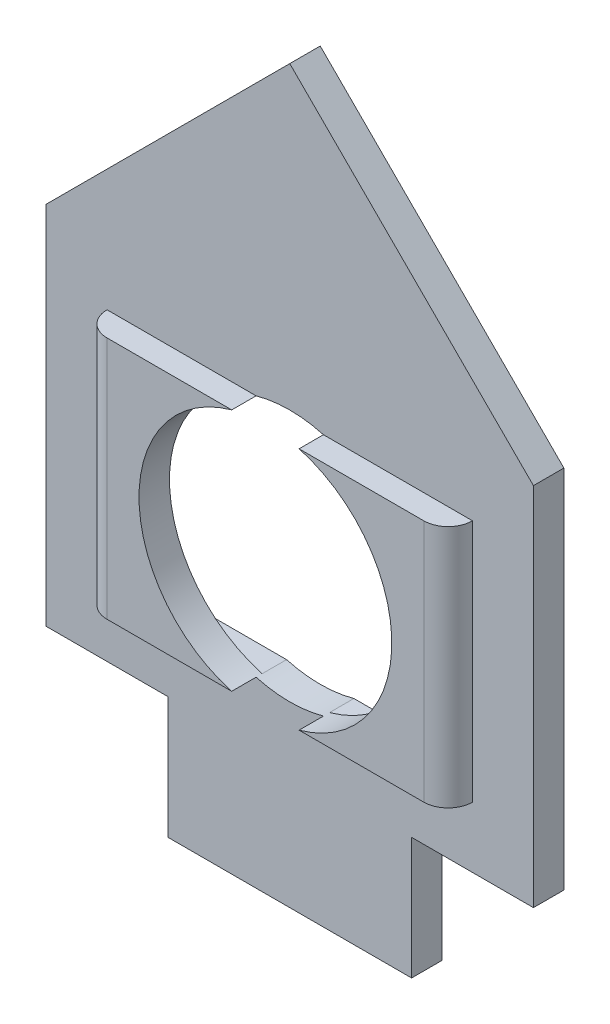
ISO-10303-21;
HEADER;
FILE_DESCRIPTION(('STEP AP214'),'2;1');
FILE_NAME('part.step','',(''),(''),'','','');
FILE_SCHEMA(('AUTOMOTIVE_DESIGN { 1 0 10303 214 1 1 1 1 }'));
ENDSEC;
DATA;
#1=APPLICATION_CONTEXT('core data for automotive mechanical design processes');
#2=APPLICATION_PROTOCOL_DEFINITION('international standard','automotive_design',2000,#1);
#3=PRODUCT_CONTEXT('',#1,'mechanical');
#4=PRODUCT('Part','Part','',(#3));
#5=PRODUCT_RELATED_PRODUCT_CATEGORY('part','',(#4));
#6=PRODUCT_DEFINITION_FORMATION('','',#4);
#7=PRODUCT_DEFINITION_CONTEXT('part definition',#1,'design');
#8=PRODUCT_DEFINITION('design','',#6,#7);
#9=PRODUCT_DEFINITION_SHAPE('','',#8);
#10=(LENGTH_UNIT() NAMED_UNIT(*) SI_UNIT(.MILLI.,.METRE.));
#11=(NAMED_UNIT(*) PLANE_ANGLE_UNIT() SI_UNIT($,.RADIAN.));
#12=(NAMED_UNIT(*) SI_UNIT($,.STERADIAN.) SOLID_ANGLE_UNIT());
#13=UNCERTAINTY_MEASURE_WITH_UNIT(LENGTH_MEASURE(1.E-05),#10,'distance_accuracy_value','');
#14=(GEOMETRIC_REPRESENTATION_CONTEXT(3) GLOBAL_UNCERTAINTY_ASSIGNED_CONTEXT((#13)) GLOBAL_UNIT_ASSIGNED_CONTEXT((#10,
#11,#12)) REPRESENTATION_CONTEXT('',''));
#15=CARTESIAN_POINT('',(0.,0.,0.));
#16=DIRECTION('',(0.,0.,1.));
#17=DIRECTION('',(1.,0.,0.));
#18=AXIS2_PLACEMENT_3D('',#15,#16,#17);
#19=CARTESIAN_POINT('',(6.,6.,1.8));
#20=DIRECTION('',(0.,1.,0.));
#21=DIRECTION('',(0.,0.,1.));
#22=AXIS2_PLACEMENT_3D('',#19,#20,#21);
#23=PLANE('',#22);
#24=DIRECTION('',(1.,0.,0.));
#25=VECTOR('',#24,1.);
#26=CARTESIAN_POINT('',(6.,6.,1.8));
#27=LINE('',#26,#25);
#28=CARTESIAN_POINT('',(1.1056672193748,6.,1.8));
#29=VERTEX_POINT('',#28);
#30=CARTESIAN_POINT('',(5.2,6.,1.8));
#31=VERTEX_POINT('',#30);
#32=EDGE_CURVE('E232',#29,#31,#27,.T.);
#33=ORIENTED_EDGE('',*,*,#32,.F.);
#34=DIRECTION('',(0.,0.,-1.));
#35=VECTOR('',#34,1.);
#36=CARTESIAN_POINT('',(1.1056672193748,6.,6.2));
#37=LINE('',#36,#35);
#38=CARTESIAN_POINT('',(1.1056672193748,6.,1.));
#39=VERTEX_POINT('',#38);
#40=EDGE_CURVE('E44',#29,#39,#37,.T.);
#41=ORIENTED_EDGE('',*,*,#40,.T.);
#42=DIRECTION('',(1.,0.,0.));
#43=VECTOR('',#42,1.);
#44=CARTESIAN_POINT('',(6.,6.,1.));
#45=LINE('',#44,#43);
#46=CARTESIAN_POINT('',(6.,6.,1.));
#47=VERTEX_POINT('',#46);
#48=EDGE_CURVE('E217',#39,#47,#45,.T.);
#49=ORIENTED_EDGE('',*,*,#48,.T.);
#50=CARTESIAN_POINT('',(5.2,6.,1.));
#51=DIRECTION('',(0.,1.,0.));
#52=DIRECTION('',(0.,0.,1.));
#53=AXIS2_PLACEMENT_3D('',#50,#51,#52);
#54=CIRCLE('',#53,0.8);
#55=EDGE_CURVE('E317',#47,#31,#54,.F.);
#56=ORIENTED_EDGE('',*,*,#55,.T.);
#57=EDGE_LOOP('',(#33,#41,#49,#56));
#58=FACE_BOUND('',#57,.T.);
#59=ADVANCED_FACE('F29',(#58),#23,.F.);
#60=CARTESIAN_POINT('',(6.,14.,1.8));
#61=DIRECTION('',(0.,-1.,0.));
#62=DIRECTION('',(0.,0.,-1.));
#63=AXIS2_PLACEMENT_3D('',#60,#61,#62);
#64=PLANE('',#63);
#65=DIRECTION('',(-1.,0.,0.));
#66=VECTOR('',#65,1.);
#67=CARTESIAN_POINT('',(6.,14.,1.8));
#68=LINE('',#67,#66);
#69=CARTESIAN_POINT('',(-1.1056672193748,14.,1.8));
#70=VERTEX_POINT('',#69);
#71=CARTESIAN_POINT('',(-5.2,14.,1.8));
#72=VERTEX_POINT('',#71);
#73=EDGE_CURVE('E236',#70,#72,#68,.T.);
#74=ORIENTED_EDGE('',*,*,#73,.F.);
#75=DIRECTION('',(0.,0.,-1.));
#76=VECTOR('',#75,1.);
#77=CARTESIAN_POINT('',(-1.1056672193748,14.,6.2));
#78=LINE('',#77,#76);
#79=CARTESIAN_POINT('',(-1.1056672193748,14.,1.));
#80=VERTEX_POINT('',#79);
#81=EDGE_CURVE('E362',#70,#80,#78,.T.);
#82=ORIENTED_EDGE('',*,*,#81,.T.);
#83=DIRECTION('',(-1.,0.,0.));
#84=VECTOR('',#83,1.);
#85=CARTESIAN_POINT('',(6.,14.,1.));
#86=LINE('',#85,#84);
#87=CARTESIAN_POINT('',(-6.,14.,1.));
#88=VERTEX_POINT('',#87);
#89=EDGE_CURVE('E228',#80,#88,#86,.T.);
#90=ORIENTED_EDGE('',*,*,#89,.T.);
#91=CARTESIAN_POINT('',(-5.2,14.,1.));
#92=DIRECTION('',(0.,-1.,0.));
#93=DIRECTION('',(0.,0.,-1.));
#94=AXIS2_PLACEMENT_3D('',#91,#92,#93);
#95=CIRCLE('',#94,0.8);
#96=EDGE_CURVE('E324',#88,#72,#95,.F.);
#97=ORIENTED_EDGE('',*,*,#96,.T.);
#98=EDGE_LOOP('',(#74,#82,#90,#97));
#99=FACE_BOUND('',#98,.T.);
#100=ADVANCED_FACE('F427',(#99),#64,.F.);
#101=CARTESIAN_POINT('',(-6.,14.,1.8));
#102=DIRECTION('',(0.,0.,1.));
#103=DIRECTION('',(1.,0.,0.));
#104=AXIS2_PLACEMENT_3D('',#101,#102,#103);
#105=PLANE('',#104);
#106=CARTESIAN_POINT('',(0.,10.,1.8));
#107=DIRECTION('',(0.,0.,1.));
#108=DIRECTION('',(1.,0.,0.));
#109=AXIS2_PLACEMENT_3D('',#106,#107,#108);
#110=CIRCLE('',#109,4.15);
#111=CARTESIAN_POINT('',(-1.1056672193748,6.,1.8));
#112=VERTEX_POINT('',#111);
#113=EDGE_CURVE('E361',#70,#112,#110,.T.);
#114=ORIENTED_EDGE('',*,*,#113,.F.);
#115=ORIENTED_EDGE('',*,*,#73,.T.);
#116=DIRECTION('',(0.,-1.,0.));
#117=VECTOR('',#116,1.);
#118=CARTESIAN_POINT('',(-5.2,14.,1.8));
#119=LINE('',#118,#117);
#120=CARTESIAN_POINT('',(-5.2,6.,1.8));
#121=VERTEX_POINT('',#120);
#122=EDGE_CURVE('E314',#72,#121,#119,.T.);
#123=ORIENTED_EDGE('',*,*,#122,.T.);
#124=EDGE_CURVE('E233',#121,#112,#27,.T.);
#125=ORIENTED_EDGE('',*,*,#124,.T.);
#126=EDGE_LOOP('',(#114,#115,#123,#125));
#127=FACE_BOUND('',#126,.T.);
#128=ADVANCED_FACE('F394',(#127),#105,.T.);
#129=CARTESIAN_POINT('',(6.,14.,0.8));
#130=DIRECTION('',(0.,1.,0.));
#131=DIRECTION('',(0.,0.,1.));
#132=AXIS2_PLACEMENT_3D('',#129,#130,#131);
#133=PLANE('',#132);
#134=DIRECTION('',(1.,0.,0.));
#135=VECTOR('',#134,1.);
#136=CARTESIAN_POINT('',(6.,14.,0.8));
#137=LINE('',#136,#135);
#138=CARTESIAN_POINT('',(1.1056672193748,14.,0.8));
#139=VERTEX_POINT('',#138);
#140=CARTESIAN_POINT('',(6.,14.,0.8));
#141=VERTEX_POINT('',#140);
#142=EDGE_CURVE('E214',#139,#141,#137,.T.);
#143=ORIENTED_EDGE('',*,*,#142,.F.);
#144=DIRECTION('',(0.,0.,-1.));
#145=VECTOR('',#144,1.);
#146=CARTESIAN_POINT('',(1.1056672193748,14.,6.2));
#147=LINE('',#146,#145);
#148=CARTESIAN_POINT('',(1.1056672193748,14.,0.));
#149=VERTEX_POINT('',#148);
#150=EDGE_CURVE('E375',#139,#149,#147,.T.);
#151=ORIENTED_EDGE('',*,*,#150,.T.);
#152=DIRECTION('',(1.,0.,0.));
#153=VECTOR('',#152,1.);
#154=CARTESIAN_POINT('',(6.,14.,0.));
#155=LINE('',#154,#153);
#156=CARTESIAN_POINT('',(6.8,14.,0.));
#157=VERTEX_POINT('',#156);
#158=EDGE_CURVE('E354',#149,#157,#155,.T.);
#159=ORIENTED_EDGE('',*,*,#158,.T.);
#160=CARTESIAN_POINT('',(6.8,14.,0.8));
#161=DIRECTION('',(0.,1.,0.));
#162=DIRECTION('',(0.,0.,1.));
#163=AXIS2_PLACEMENT_3D('',#160,#161,#162);
#164=CIRCLE('',#163,0.8);
#165=EDGE_CURVE('E330',#157,#141,#164,.T.);
#166=ORIENTED_EDGE('',*,*,#165,.T.);
#167=EDGE_LOOP('',(#143,#151,#159,#166));
#168=FACE_BOUND('',#167,.T.);
#169=ADVANCED_FACE('F524',(#168),#133,.F.);
#170=CARTESIAN_POINT('',(6.,6.,0.8));
#171=DIRECTION('',(0.,-1.,0.));
#172=DIRECTION('',(0.,0.,-1.));
#173=AXIS2_PLACEMENT_3D('',#170,#171,#172);
#174=PLANE('',#173);
#175=DIRECTION('',(-1.,0.,0.));
#176=VECTOR('',#175,1.);
#177=CARTESIAN_POINT('',(6.,6.,0.8));
#178=LINE('',#177,#176);
#179=CARTESIAN_POINT('',(-1.1056672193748,6.,0.8));
#180=VERTEX_POINT('',#179);
#181=CARTESIAN_POINT('',(-6.,6.,0.8));
#182=VERTEX_POINT('',#181);
#183=EDGE_CURVE('E338',#180,#182,#178,.T.);
#184=ORIENTED_EDGE('',*,*,#183,.F.);
#185=DIRECTION('',(0.,0.,-1.));
#186=VECTOR('',#185,1.);
#187=CARTESIAN_POINT('',(-1.1056672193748,6.,6.2));
#188=LINE('',#187,#186);
#189=CARTESIAN_POINT('',(-1.1056672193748,6.,0.));
#190=VERTEX_POINT('',#189);
#191=EDGE_CURVE('E52',#180,#190,#188,.T.);
#192=ORIENTED_EDGE('',*,*,#191,.T.);
#193=DIRECTION('',(-1.,0.,0.));
#194=VECTOR('',#193,1.);
#195=CARTESIAN_POINT('',(6.,6.,0.));
#196=LINE('',#195,#194);
#197=CARTESIAN_POINT('',(-6.8,6.,0.));
#198=VERTEX_POINT('',#197);
#199=EDGE_CURVE('E340',#190,#198,#196,.T.);
#200=ORIENTED_EDGE('',*,*,#199,.T.);
#201=CARTESIAN_POINT('',(-6.8,6.,0.8));
#202=DIRECTION('',(0.,-1.,0.));
#203=DIRECTION('',(0.,0.,-1.));
#204=AXIS2_PLACEMENT_3D('',#201,#202,#203);
#205=CIRCLE('',#204,0.8);
#206=EDGE_CURVE('E199',#198,#182,#205,.T.);
#207=ORIENTED_EDGE('',*,*,#206,.T.);
#208=EDGE_LOOP('',(#184,#192,#200,#207));
#209=FACE_BOUND('',#208,.T.);
#210=ADVANCED_FACE('F337',(#209),#174,.F.);
#211=CARTESIAN_POINT('',(6.,6.,0.8));
#212=DIRECTION('',(0.,0.,-1.));
#213=DIRECTION('',(-1.,0.,0.));
#214=AXIS2_PLACEMENT_3D('',#211,#212,#213);
#215=PLANE('',#214);
#216=CARTESIAN_POINT('',(0.,10.,0.8));
#217=DIRECTION('',(0.,0.,-1.));
#218=DIRECTION('',(-1.,0.,0.));
#219=AXIS2_PLACEMENT_3D('',#216,#217,#218);
#220=CIRCLE('',#219,4.15);
#221=CARTESIAN_POINT('',(1.1056672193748,6.,0.8));
#222=VERTEX_POINT('',#221);
#223=EDGE_CURVE('E11',#139,#222,#220,.T.);
#224=ORIENTED_EDGE('',*,*,#223,.F.);
#225=ORIENTED_EDGE('',*,*,#142,.T.);
#226=DIRECTION('',(0.,-1.,0.));
#227=VECTOR('',#226,1.);
#228=CARTESIAN_POINT('',(6.,14.,0.8));
#229=LINE('',#228,#227);
#230=CARTESIAN_POINT('',(6.,6.,0.8));
#231=VERTEX_POINT('',#230);
#232=EDGE_CURVE('E350',#141,#231,#229,.T.);
#233=ORIENTED_EDGE('',*,*,#232,.T.);
#234=EDGE_CURVE('E344',#231,#222,#178,.T.);
#235=ORIENTED_EDGE('',*,*,#234,.T.);
#236=EDGE_LOOP('',(#224,#225,#233,#235));
#237=FACE_BOUND('',#236,.T.);
#238=ADVANCED_FACE('F449',(#237),#215,.T.);
#239=CARTESIAN_POINT('',(-3.99999999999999,4.,1.));
#240=DIRECTION('',(0.,0.,-1.));
#241=DIRECTION('',(-1.,0.,0.));
#242=AXIS2_PLACEMENT_3D('',#239,#240,#241);
#243=PLANE('',#242);
#244=DIRECTION('',(1.,0.,0.));
#245=VECTOR('',#244,1.);
#246=CARTESIAN_POINT('',(-3.99999999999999,4.,1.));
#247=LINE('',#246,#245);
#248=CARTESIAN_POINT('',(-7.99999999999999,4.,1.));
#249=VERTEX_POINT('',#248);
#250=CARTESIAN_POINT('',(-3.99999999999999,4.,1.));
#251=VERTEX_POINT('',#250);
#252=EDGE_CURVE('E259',#249,#251,#247,.T.);
#253=ORIENTED_EDGE('',*,*,#252,.T.);
#254=DIRECTION('',(0.,-1.,0.));
#255=VECTOR('',#254,1.);
#256=CARTESIAN_POINT('',(-3.99999999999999,0.,1.));
#257=LINE('',#256,#255);
#258=CARTESIAN_POINT('',(-3.99999999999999,0.,1.));
#259=VERTEX_POINT('',#258);
#260=EDGE_CURVE('E262',#251,#259,#257,.T.);
#261=ORIENTED_EDGE('',*,*,#260,.T.);
#262=DIRECTION('',(1.,0.,0.));
#263=VECTOR('',#262,1.);
#264=CARTESIAN_POINT('',(-3.99999999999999,0.,1.));
#265=LINE('',#264,#263);
#266=CARTESIAN_POINT('',(4.00000000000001,0.,1.));
#267=VERTEX_POINT('',#266);
#268=EDGE_CURVE('E264',#259,#267,#265,.T.);
#269=ORIENTED_EDGE('',*,*,#268,.T.);
#270=DIRECTION('',(0.,1.,0.));
#271=VECTOR('',#270,1.);
#272=CARTESIAN_POINT('',(4.00000000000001,0.,1.));
#273=LINE('',#272,#271);
#274=CARTESIAN_POINT('',(4.00000000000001,4.,1.));
#275=VERTEX_POINT('',#274);
#276=EDGE_CURVE('E266',#267,#275,#273,.T.);
#277=ORIENTED_EDGE('',*,*,#276,.T.);
#278=DIRECTION('',(1.,0.,0.));
#279=VECTOR('',#278,1.);
#280=CARTESIAN_POINT('',(4.00000000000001,4.,1.));
#281=LINE('',#280,#279);
#282=CARTESIAN_POINT('',(8.00000000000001,4.,1.));
#283=VERTEX_POINT('',#282);
#284=EDGE_CURVE('E268',#275,#283,#281,.T.);
#285=ORIENTED_EDGE('',*,*,#284,.T.);
#286=DIRECTION('',(0.,1.,0.));
#287=VECTOR('',#286,1.);
#288=CARTESIAN_POINT('',(8.00000000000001,4.,1.));
#289=LINE('',#288,#287);
#290=CARTESIAN_POINT('',(8.00000000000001,15.9999999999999,1.));
#291=VERTEX_POINT('',#290);
#292=EDGE_CURVE('E270',#283,#291,#289,.T.);
#293=ORIENTED_EDGE('',*,*,#292,.T.);
#294=DIRECTION('',(-0.707106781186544,0.707106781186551,0.));
#295=VECTOR('',#294,1.);
#296=CARTESIAN_POINT('',(8.00000000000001,15.9999999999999,1.));
#297=LINE('',#296,#295);
#298=CARTESIAN_POINT('',(0.,24.,1.));
#299=VERTEX_POINT('',#298);
#300=EDGE_CURVE('E272',#291,#299,#297,.T.);
#301=ORIENTED_EDGE('',*,*,#300,.T.);
#302=DIRECTION('',(-0.707106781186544,-0.707106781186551,0.));
#303=VECTOR('',#302,1.);
#304=CARTESIAN_POINT('',(-7.99999999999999,15.9999999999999,1.));
#305=LINE('',#304,#303);
#306=CARTESIAN_POINT('',(-7.99999999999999,15.9999999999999,1.));
#307=VERTEX_POINT('',#306);
#308=EDGE_CURVE('E274',#299,#307,#305,.T.);
#309=ORIENTED_EDGE('',*,*,#308,.T.);
#310=DIRECTION('',(0.,-1.,0.));
#311=VECTOR('',#310,1.);
#312=CARTESIAN_POINT('',(-7.99999999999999,4.,1.));
#313=LINE('',#312,#311);
#314=EDGE_CURVE('E276',#307,#249,#313,.T.);
#315=ORIENTED_EDGE('',*,*,#314,.T.);
#316=EDGE_LOOP('',(#253,#261,#269,#277,#285,#293,#301,#309,#315));
#317=FACE_BOUND('',#316,.T.);
#318=ORIENTED_EDGE('',*,*,#89,.F.);
#319=CARTESIAN_POINT('',(0.,10.,1.));
#320=DIRECTION('',(0.,0.,-1.));
#321=DIRECTION('',(-1.,0.,0.));
#322=AXIS2_PLACEMENT_3D('',#319,#320,#321);
#323=CIRCLE('',#322,4.15);
#324=CARTESIAN_POINT('',(1.1056672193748,14.,1.));
#325=VERTEX_POINT('',#324);
#326=EDGE_CURVE('E365',#80,#325,#323,.T.);
#327=ORIENTED_EDGE('',*,*,#326,.T.);
#328=CARTESIAN_POINT('',(6.,14.,1.));
#329=VERTEX_POINT('',#328);
#330=EDGE_CURVE('E229',#329,#325,#86,.T.);
#331=ORIENTED_EDGE('',*,*,#330,.F.);
#332=DIRECTION('',(0.,1.,0.));
#333=VECTOR('',#332,1.);
#334=CARTESIAN_POINT('',(6.,14.,1.));
#335=LINE('',#334,#333);
#336=EDGE_CURVE('E225',#47,#329,#335,.T.);
#337=ORIENTED_EDGE('',*,*,#336,.F.);
#338=ORIENTED_EDGE('',*,*,#48,.F.);
#339=CARTESIAN_POINT('',(-1.1056672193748,6.,1.));
#340=VERTEX_POINT('',#339);
#341=EDGE_CURVE('E366',#39,#340,#323,.T.);
#342=ORIENTED_EDGE('',*,*,#341,.T.);
#343=CARTESIAN_POINT('',(-6.,6.,1.));
#344=VERTEX_POINT('',#343);
#345=EDGE_CURVE('E222',#344,#340,#45,.T.);
#346=ORIENTED_EDGE('',*,*,#345,.F.);
#347=DIRECTION('',(0.,-1.,0.));
#348=VECTOR('',#347,1.);
#349=CARTESIAN_POINT('',(-6.,6.,1.));
#350=LINE('',#349,#348);
#351=EDGE_CURVE('E213',#88,#344,#350,.T.);
#352=ORIENTED_EDGE('',*,*,#351,.F.);
#353=EDGE_LOOP('',(#318,#327,#331,#337,#338,#342,#346,#352));
#354=FACE_BOUND('',#353,.T.);
#355=ADVANCED_FACE('F402',(#317,#354),#243,.F.);
#356=CARTESIAN_POINT('',(-3.99999999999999,4.,1.));
#357=DIRECTION('',(0.,1.,0.));
#358=DIRECTION('',(-1.,0.,0.));
#359=AXIS2_PLACEMENT_3D('',#356,#357,#358);
#360=PLANE('',#359);
#361=DIRECTION('',(1.,0.,0.));
#362=VECTOR('',#361,1.);
#363=CARTESIAN_POINT('',(-3.99999999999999,4.,0.));
#364=LINE('',#363,#362);
#365=CARTESIAN_POINT('',(-7.99999999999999,4.,0.));
#366=VERTEX_POINT('',#365);
#367=CARTESIAN_POINT('',(-3.99999999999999,4.,0.));
#368=VERTEX_POINT('',#367);
#369=EDGE_CURVE('E240',#366,#368,#364,.T.);
#370=ORIENTED_EDGE('',*,*,#369,.T.);
#371=DIRECTION('',(0.,0.,-1.));
#372=VECTOR('',#371,1.);
#373=CARTESIAN_POINT('',(-3.99999999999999,4.,1.));
#374=LINE('',#373,#372);
#375=EDGE_CURVE('E302',#251,#368,#374,.T.);
#376=ORIENTED_EDGE('',*,*,#375,.F.);
#377=ORIENTED_EDGE('',*,*,#252,.F.);
#378=DIRECTION('',(0.,0.,-1.));
#379=VECTOR('',#378,1.);
#380=CARTESIAN_POINT('',(-7.99999999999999,4.,1.));
#381=LINE('',#380,#379);
#382=EDGE_CURVE('E278',#249,#366,#381,.T.);
#383=ORIENTED_EDGE('',*,*,#382,.T.);
#384=EDGE_LOOP('',(#370,#376,#377,#383));
#385=FACE_BOUND('',#384,.T.);
#386=ADVANCED_FACE('F31',(#385),#360,.F.);
#387=CARTESIAN_POINT('',(-3.99999999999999,0.,1.));
#388=DIRECTION('',(1.,0.,0.));
#389=DIRECTION('',(0.,1.,0.));
#390=AXIS2_PLACEMENT_3D('',#387,#388,#389);
#391=PLANE('',#390);
#392=DIRECTION('',(0.,-1.,0.));
#393=VECTOR('',#392,1.);
#394=CARTESIAN_POINT('',(-3.99999999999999,0.,0.));
#395=LINE('',#394,#393);
#396=CARTESIAN_POINT('',(-3.99999999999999,0.,0.));
#397=VERTEX_POINT('',#396);
#398=EDGE_CURVE('E243',#368,#397,#395,.T.);
#399=ORIENTED_EDGE('',*,*,#398,.T.);
#400=DIRECTION('',(0.,0.,-1.));
#401=VECTOR('',#400,1.);
#402=CARTESIAN_POINT('',(-3.99999999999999,0.,1.));
#403=LINE('',#402,#401);
#404=EDGE_CURVE('E299',#259,#397,#403,.T.);
#405=ORIENTED_EDGE('',*,*,#404,.F.);
#406=ORIENTED_EDGE('',*,*,#260,.F.);
#407=ORIENTED_EDGE('',*,*,#375,.T.);
#408=EDGE_LOOP('',(#399,#405,#406,#407));
#409=FACE_BOUND('',#408,.T.);
#410=ADVANCED_FACE('F473',(#409),#391,.F.);
#411=CARTESIAN_POINT('',(-3.99999999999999,0.,1.));
#412=DIRECTION('',(0.,1.,0.));
#413=DIRECTION('',(-1.,0.,0.));
#414=AXIS2_PLACEMENT_3D('',#411,#412,#413);
#415=PLANE('',#414);
#416=DIRECTION('',(1.,0.,0.));
#417=VECTOR('',#416,1.);
#418=CARTESIAN_POINT('',(-3.99999999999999,0.,0.));
#419=LINE('',#418,#417);
#420=CARTESIAN_POINT('',(4.00000000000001,0.,0.));
#421=VERTEX_POINT('',#420);
#422=EDGE_CURVE('E245',#397,#421,#419,.T.);
#423=ORIENTED_EDGE('',*,*,#422,.T.);
#424=DIRECTION('',(0.,0.,-1.));
#425=VECTOR('',#424,1.);
#426=CARTESIAN_POINT('',(4.00000000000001,0.,1.));
#427=LINE('',#426,#425);
#428=EDGE_CURVE('E296',#267,#421,#427,.T.);
#429=ORIENTED_EDGE('',*,*,#428,.F.);
#430=ORIENTED_EDGE('',*,*,#268,.F.);
#431=ORIENTED_EDGE('',*,*,#404,.T.);
#432=EDGE_LOOP('',(#423,#429,#430,#431));
#433=FACE_BOUND('',#432,.T.);
#434=ADVANCED_FACE('F470',(#433),#415,.F.);
#435=CARTESIAN_POINT('',(4.00000000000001,0.,1.));
#436=DIRECTION('',(-1.,0.,0.));
#437=DIRECTION('',(0.,0.,1.));
#438=AXIS2_PLACEMENT_3D('',#435,#436,#437);
#439=PLANE('',#438);
#440=DIRECTION('',(0.,1.,0.));
#441=VECTOR('',#440,1.);
#442=CARTESIAN_POINT('',(4.00000000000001,0.,0.));
#443=LINE('',#442,#441);
#444=CARTESIAN_POINT('',(4.00000000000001,4.,0.));
#445=VERTEX_POINT('',#444);
#446=EDGE_CURVE('E247',#421,#445,#443,.T.);
#447=ORIENTED_EDGE('',*,*,#446,.T.);
#448=DIRECTION('',(0.,0.,-1.));
#449=VECTOR('',#448,1.);
#450=CARTESIAN_POINT('',(4.00000000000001,4.,1.));
#451=LINE('',#450,#449);
#452=EDGE_CURVE('E293',#275,#445,#451,.T.);
#453=ORIENTED_EDGE('',*,*,#452,.F.);
#454=ORIENTED_EDGE('',*,*,#276,.F.);
#455=ORIENTED_EDGE('',*,*,#428,.T.);
#456=EDGE_LOOP('',(#447,#453,#454,#455));
#457=FACE_BOUND('',#456,.T.);
#458=ADVANCED_FACE('F466',(#457),#439,.F.);
#459=CARTESIAN_POINT('',(4.00000000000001,4.,1.));
#460=DIRECTION('',(0.,1.,0.));
#461=DIRECTION('',(-1.,0.,0.));
#462=AXIS2_PLACEMENT_3D('',#459,#460,#461);
#463=PLANE('',#462);
#464=DIRECTION('',(1.,0.,0.));
#465=VECTOR('',#464,1.);
#466=CARTESIAN_POINT('',(4.00000000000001,4.,0.));
#467=LINE('',#466,#465);
#468=CARTESIAN_POINT('',(8.00000000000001,4.,0.));
#469=VERTEX_POINT('',#468);
#470=EDGE_CURVE('E249',#445,#469,#467,.T.);
#471=ORIENTED_EDGE('',*,*,#470,.T.);
#472=DIRECTION('',(0.,0.,-1.));
#473=VECTOR('',#472,1.);
#474=CARTESIAN_POINT('',(8.00000000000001,4.,1.));
#475=LINE('',#474,#473);
#476=EDGE_CURVE('E290',#283,#469,#475,.T.);
#477=ORIENTED_EDGE('',*,*,#476,.F.);
#478=ORIENTED_EDGE('',*,*,#284,.F.);
#479=ORIENTED_EDGE('',*,*,#452,.T.);
#480=EDGE_LOOP('',(#471,#477,#478,#479));
#481=FACE_BOUND('',#480,.T.);
#482=ADVANCED_FACE('F462',(#481),#463,.F.);
#483=CARTESIAN_POINT('',(8.00000000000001,4.,1.));
#484=DIRECTION('',(-1.,0.,0.));
#485=DIRECTION('',(0.,0.,1.));
#486=AXIS2_PLACEMENT_3D('',#483,#484,#485);
#487=PLANE('',#486);
#488=DIRECTION('',(0.,1.,0.));
#489=VECTOR('',#488,1.);
#490=CARTESIAN_POINT('',(8.00000000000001,4.,0.));
#491=LINE('',#490,#489);
#492=CARTESIAN_POINT('',(8.00000000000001,15.9999999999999,0.));
#493=VERTEX_POINT('',#492);
#494=EDGE_CURVE('E251',#469,#493,#491,.T.);
#495=ORIENTED_EDGE('',*,*,#494,.T.);
#496=DIRECTION('',(0.,0.,-1.));
#497=VECTOR('',#496,1.);
#498=CARTESIAN_POINT('',(8.00000000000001,15.9999999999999,1.));
#499=LINE('',#498,#497);
#500=EDGE_CURVE('E287',#291,#493,#499,.T.);
#501=ORIENTED_EDGE('',*,*,#500,.F.);
#502=ORIENTED_EDGE('',*,*,#292,.F.);
#503=ORIENTED_EDGE('',*,*,#476,.T.);
#504=EDGE_LOOP('',(#495,#501,#502,#503));
#505=FACE_BOUND('',#504,.T.);
#506=ADVANCED_FACE('F458',(#505),#487,.F.);
#507=CARTESIAN_POINT('',(8.00000000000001,15.9999999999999,1.));
#508=DIRECTION('',(-0.707106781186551,-0.707106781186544,0.));
#509=DIRECTION('',(0.707106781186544,-0.707106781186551,0.));
#510=AXIS2_PLACEMENT_3D('',#507,#508,#509);
#511=PLANE('',#510);
#512=DIRECTION('',(-0.707106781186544,0.707106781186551,0.));
#513=VECTOR('',#512,1.);
#514=CARTESIAN_POINT('',(8.00000000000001,15.9999999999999,0.));
#515=LINE('',#514,#513);
#516=CARTESIAN_POINT('',(0.,24.,0.));
#517=VERTEX_POINT('',#516);
#518=EDGE_CURVE('E253',#493,#517,#515,.T.);
#519=ORIENTED_EDGE('',*,*,#518,.T.);
#520=DIRECTION('',(0.,0.,-1.));
#521=VECTOR('',#520,1.);
#522=CARTESIAN_POINT('',(0.,24.,1.));
#523=LINE('',#522,#521);
#524=EDGE_CURVE('E284',#299,#517,#523,.T.);
#525=ORIENTED_EDGE('',*,*,#524,.F.);
#526=ORIENTED_EDGE('',*,*,#300,.F.);
#527=ORIENTED_EDGE('',*,*,#500,.T.);
#528=EDGE_LOOP('',(#519,#525,#526,#527));
#529=FACE_BOUND('',#528,.T.);
#530=ADVANCED_FACE('F454',(#529),#511,.F.);
#531=CARTESIAN_POINT('',(-7.99999999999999,15.9999999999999,1.));
#532=DIRECTION('',(0.707106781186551,-0.707106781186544,0.));
#533=DIRECTION('',(0.707106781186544,0.707106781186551,0.));
#534=AXIS2_PLACEMENT_3D('',#531,#532,#533);
#535=PLANE('',#534);
#536=DIRECTION('',(-0.707106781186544,-0.707106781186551,0.));
#537=VECTOR('',#536,1.);
#538=CARTESIAN_POINT('',(-7.99999999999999,15.9999999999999,0.));
#539=LINE('',#538,#537);
#540=CARTESIAN_POINT('',(-7.99999999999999,15.9999999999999,0.));
#541=VERTEX_POINT('',#540);
#542=EDGE_CURVE('E255',#517,#541,#539,.T.);
#543=ORIENTED_EDGE('',*,*,#542,.T.);
#544=DIRECTION('',(0.,0.,-1.));
#545=VECTOR('',#544,1.);
#546=CARTESIAN_POINT('',(-7.99999999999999,15.9999999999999,1.));
#547=LINE('',#546,#545);
#548=EDGE_CURVE('E281',#307,#541,#547,.T.);
#549=ORIENTED_EDGE('',*,*,#548,.F.);
#550=ORIENTED_EDGE('',*,*,#308,.F.);
#551=ORIENTED_EDGE('',*,*,#524,.T.);
#552=EDGE_LOOP('',(#543,#549,#550,#551));
#553=FACE_BOUND('',#552,.T.);
#554=ADVANCED_FACE('F444',(#553),#535,.F.);
#555=CARTESIAN_POINT('',(-7.99999999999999,4.,1.));
#556=DIRECTION('',(1.,0.,0.));
#557=DIRECTION('',(0.,1.,0.));
#558=AXIS2_PLACEMENT_3D('',#555,#556,#557);
#559=PLANE('',#558);
#560=DIRECTION('',(0.,-1.,0.));
#561=VECTOR('',#560,1.);
#562=CARTESIAN_POINT('',(-7.99999999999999,4.,0.));
#563=LINE('',#562,#561);
#564=EDGE_CURVE('E257',#541,#366,#563,.T.);
#565=ORIENTED_EDGE('',*,*,#564,.T.);
#566=ORIENTED_EDGE('',*,*,#382,.F.);
#567=ORIENTED_EDGE('',*,*,#314,.F.);
#568=ORIENTED_EDGE('',*,*,#548,.T.);
#569=EDGE_LOOP('',(#565,#566,#567,#568));
#570=FACE_BOUND('',#569,.T.);
#571=ADVANCED_FACE('F440',(#570),#559,.F.);
#572=CARTESIAN_POINT('',(-3.99999999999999,4.,0.));
#573=DIRECTION('',(0.,0.,-1.));
#574=DIRECTION('',(-1.,0.,0.));
#575=AXIS2_PLACEMENT_3D('',#572,#573,#574);
#576=PLANE('',#575);
#577=CARTESIAN_POINT('',(0.,10.,0.));
#578=DIRECTION('',(0.,0.,-1.));
#579=DIRECTION('',(-1.,0.,0.));
#580=AXIS2_PLACEMENT_3D('',#577,#578,#579);
#581=CIRCLE('',#580,4.15);
#582=CARTESIAN_POINT('',(-1.1056672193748,14.,0.));
#583=VERTEX_POINT('',#582);
#584=EDGE_CURVE('E381',#583,#149,#581,.T.);
#585=ORIENTED_EDGE('',*,*,#584,.F.);
#586=CARTESIAN_POINT('',(-6.8,14.,0.));
#587=VERTEX_POINT('',#586);
#588=EDGE_CURVE('E206',#587,#583,#155,.T.);
#589=ORIENTED_EDGE('',*,*,#588,.F.);
#590=DIRECTION('',(0.,1.,0.));
#591=VECTOR('',#590,1.);
#592=CARTESIAN_POINT('',(-6.8,14.,0.));
#593=LINE('',#592,#591);
#594=EDGE_CURVE('E305',#587,#198,#593,.F.);
#595=ORIENTED_EDGE('',*,*,#594,.T.);
#596=ORIENTED_EDGE('',*,*,#199,.F.);
#597=CARTESIAN_POINT('',(1.1056672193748,6.,0.));
#598=VERTEX_POINT('',#597);
#599=EDGE_CURVE('E207',#598,#190,#581,.T.);
#600=ORIENTED_EDGE('',*,*,#599,.F.);
#601=CARTESIAN_POINT('',(6.8,6.,0.));
#602=VERTEX_POINT('',#601);
#603=EDGE_CURVE('E355',#602,#598,#196,.T.);
#604=ORIENTED_EDGE('',*,*,#603,.F.);
#605=DIRECTION('',(0.,-1.,0.));
#606=VECTOR('',#605,1.);
#607=CARTESIAN_POINT('',(6.8,14.,0.));
#608=LINE('',#607,#606);
#609=EDGE_CURVE('E308',#602,#157,#608,.F.);
#610=ORIENTED_EDGE('',*,*,#609,.T.);
#611=ORIENTED_EDGE('',*,*,#158,.F.);
#612=EDGE_LOOP('',(#585,#589,#595,#596,#600,#604,#610,#611));
#613=FACE_BOUND('',#612,.T.);
#614=ORIENTED_EDGE('',*,*,#369,.F.);
#615=ORIENTED_EDGE('',*,*,#564,.F.);
#616=ORIENTED_EDGE('',*,*,#542,.F.);
#617=ORIENTED_EDGE('',*,*,#518,.F.);
#618=ORIENTED_EDGE('',*,*,#494,.F.);
#619=ORIENTED_EDGE('',*,*,#470,.F.);
#620=ORIENTED_EDGE('',*,*,#446,.F.);
#621=ORIENTED_EDGE('',*,*,#422,.F.);
#622=ORIENTED_EDGE('',*,*,#398,.F.);
#623=EDGE_LOOP('',(#614,#615,#616,#617,#618,#619,#620,#621,#622));
#624=FACE_BOUND('',#623,.T.);
#625=ADVANCED_FACE('F385',(#613,#624),#576,.T.);
#626=ORIENTED_EDGE('',*,*,#345,.T.);
#627=DIRECTION('',(0.,0.,-1.));
#628=VECTOR('',#627,1.);
#629=CARTESIAN_POINT('',(-1.1056672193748,6.,6.2));
#630=LINE('',#629,#628);
#631=EDGE_CURVE('E358',#340,#112,#630,.F.);
#632=ORIENTED_EDGE('',*,*,#631,.T.);
#633=ORIENTED_EDGE('',*,*,#124,.F.);
#634=CARTESIAN_POINT('',(-5.2,6.,1.));
#635=DIRECTION('',(0.,1.,0.));
#636=DIRECTION('',(0.,0.,1.));
#637=AXIS2_PLACEMENT_3D('',#634,#635,#636);
#638=CIRCLE('',#637,0.8);
#639=EDGE_CURVE('E320',#121,#344,#638,.F.);
#640=ORIENTED_EDGE('',*,*,#639,.T.);
#641=EDGE_LOOP('',(#626,#632,#633,#640));
#642=FACE_BOUND('',#641,.T.);
#643=ADVANCED_FACE('F392',(#642),#23,.F.);
#644=ORIENTED_EDGE('',*,*,#330,.T.);
#645=DIRECTION('',(0.,0.,-1.));
#646=VECTOR('',#645,1.);
#647=CARTESIAN_POINT('',(1.1056672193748,14.,6.2));
#648=LINE('',#647,#646);
#649=CARTESIAN_POINT('',(1.1056672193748,14.,1.8));
#650=VERTEX_POINT('',#649);
#651=EDGE_CURVE('E370',#325,#650,#648,.F.);
#652=ORIENTED_EDGE('',*,*,#651,.T.);
#653=CARTESIAN_POINT('',(5.2,14.,1.8));
#654=VERTEX_POINT('',#653);
#655=EDGE_CURVE('E237',#654,#650,#68,.T.);
#656=ORIENTED_EDGE('',*,*,#655,.F.);
#657=CARTESIAN_POINT('',(5.2,14.,1.));
#658=DIRECTION('',(0.,-1.,0.));
#659=DIRECTION('',(0.,0.,-1.));
#660=AXIS2_PLACEMENT_3D('',#657,#658,#659);
#661=CIRCLE('',#660,0.8);
#662=EDGE_CURVE('E322',#654,#329,#661,.F.);
#663=ORIENTED_EDGE('',*,*,#662,.T.);
#664=EDGE_LOOP('',(#644,#652,#656,#663));
#665=FACE_BOUND('',#664,.T.);
#666=ADVANCED_FACE('F414',(#665),#64,.F.);
#667=EDGE_CURVE('E373',#29,#650,#110,.T.);
#668=ORIENTED_EDGE('',*,*,#667,.F.);
#669=ORIENTED_EDGE('',*,*,#32,.T.);
#670=DIRECTION('',(0.,1.,0.));
#671=VECTOR('',#670,1.);
#672=CARTESIAN_POINT('',(5.2,14.,1.8));
#673=LINE('',#672,#671);
#674=EDGE_CURVE('E311',#31,#654,#673,.T.);
#675=ORIENTED_EDGE('',*,*,#674,.T.);
#676=ORIENTED_EDGE('',*,*,#655,.T.);
#677=EDGE_LOOP('',(#668,#669,#675,#676));
#678=FACE_BOUND('',#677,.T.);
#679=ADVANCED_FACE('F410',(#678),#105,.T.);
#680=ORIENTED_EDGE('',*,*,#588,.T.);
#681=DIRECTION('',(0.,0.,-1.));
#682=VECTOR('',#681,1.);
#683=CARTESIAN_POINT('',(-1.1056672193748,14.,6.2));
#684=LINE('',#683,#682);
#685=CARTESIAN_POINT('',(-1.1056672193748,14.,0.8));
#686=VERTEX_POINT('',#685);
#687=EDGE_CURVE('E194',#583,#686,#684,.F.);
#688=ORIENTED_EDGE('',*,*,#687,.T.);
#689=CARTESIAN_POINT('',(-6.,14.,0.8));
#690=VERTEX_POINT('',#689);
#691=EDGE_CURVE('E205',#690,#686,#137,.T.);
#692=ORIENTED_EDGE('',*,*,#691,.F.);
#693=CARTESIAN_POINT('',(-6.8,14.,0.8));
#694=DIRECTION('',(0.,1.,0.));
#695=DIRECTION('',(0.,0.,1.));
#696=AXIS2_PLACEMENT_3D('',#693,#694,#695);
#697=CIRCLE('',#696,0.8);
#698=EDGE_CURVE('E333',#690,#587,#697,.T.);
#699=ORIENTED_EDGE('',*,*,#698,.T.);
#700=EDGE_LOOP('',(#680,#688,#692,#699));
#701=FACE_BOUND('',#700,.T.);
#702=ADVANCED_FACE('F203',(#701),#133,.F.);
#703=ORIENTED_EDGE('',*,*,#603,.T.);
#704=DIRECTION('',(0.,0.,-1.));
#705=VECTOR('',#704,1.);
#706=CARTESIAN_POINT('',(1.1056672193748,6.,6.2));
#707=LINE('',#706,#705);
#708=EDGE_CURVE('E378',#598,#222,#707,.F.);
#709=ORIENTED_EDGE('',*,*,#708,.T.);
#710=ORIENTED_EDGE('',*,*,#234,.F.);
#711=CARTESIAN_POINT('',(6.8,6.,0.8));
#712=DIRECTION('',(0.,-1.,0.));
#713=DIRECTION('',(0.,0.,-1.));
#714=AXIS2_PLACEMENT_3D('',#711,#712,#713);
#715=CIRCLE('',#714,0.8);
#716=EDGE_CURVE('E327',#231,#602,#715,.T.);
#717=ORIENTED_EDGE('',*,*,#716,.T.);
#718=EDGE_LOOP('',(#703,#709,#710,#717));
#719=FACE_BOUND('',#718,.T.);
#720=ADVANCED_FACE('F526',(#719),#174,.F.);
#721=EDGE_CURVE('E33',#180,#686,#220,.T.);
#722=ORIENTED_EDGE('',*,*,#721,.F.);
#723=ORIENTED_EDGE('',*,*,#183,.T.);
#724=DIRECTION('',(0.,1.,0.));
#725=VECTOR('',#724,1.);
#726=CARTESIAN_POINT('',(-6.,14.,0.8));
#727=LINE('',#726,#725);
#728=EDGE_CURVE('E212',#182,#690,#727,.T.);
#729=ORIENTED_EDGE('',*,*,#728,.T.);
#730=ORIENTED_EDGE('',*,*,#691,.T.);
#731=EDGE_LOOP('',(#722,#723,#729,#730));
#732=FACE_BOUND('',#731,.T.);
#733=ADVANCED_FACE('F210',(#732),#215,.T.);
#734=CARTESIAN_POINT('',(6.8,14.,0.8));
#735=DIRECTION('',(0.,1.,0.));
#736=DIRECTION('',(0.,0.,1.));
#737=AXIS2_PLACEMENT_3D('',#734,#735,#736);
#738=CYLINDRICAL_SURFACE('',#737,0.8);
#739=ORIENTED_EDGE('',*,*,#165,.F.);
#740=ORIENTED_EDGE('',*,*,#609,.F.);
#741=ORIENTED_EDGE('',*,*,#716,.F.);
#742=ORIENTED_EDGE('',*,*,#232,.F.);
#743=EDGE_LOOP('',(#739,#740,#741,#742));
#744=FACE_BOUND('',#743,.T.);
#745=ADVANCED_FACE('F572',(#744),#738,.T.);
#746=CARTESIAN_POINT('',(-6.8,14.,0.8));
#747=DIRECTION('',(0.,-1.,0.));
#748=DIRECTION('',(0.,0.,-1.));
#749=AXIS2_PLACEMENT_3D('',#746,#747,#748);
#750=CYLINDRICAL_SURFACE('',#749,0.8);
#751=ORIENTED_EDGE('',*,*,#206,.F.);
#752=ORIENTED_EDGE('',*,*,#594,.F.);
#753=ORIENTED_EDGE('',*,*,#698,.F.);
#754=ORIENTED_EDGE('',*,*,#728,.F.);
#755=EDGE_LOOP('',(#751,#752,#753,#754));
#756=FACE_BOUND('',#755,.T.);
#757=ADVANCED_FACE('F343',(#756),#750,.T.);
#758=CARTESIAN_POINT('',(-5.2,14.,1.));
#759=DIRECTION('',(0.,1.,0.));
#760=DIRECTION('',(0.,0.,1.));
#761=AXIS2_PLACEMENT_3D('',#758,#759,#760);
#762=CYLINDRICAL_SURFACE('',#761,0.8);
#763=ORIENTED_EDGE('',*,*,#96,.F.);
#764=ORIENTED_EDGE('',*,*,#351,.T.);
#765=ORIENTED_EDGE('',*,*,#639,.F.);
#766=ORIENTED_EDGE('',*,*,#122,.F.);
#767=EDGE_LOOP('',(#763,#764,#765,#766));
#768=FACE_BOUND('',#767,.T.);
#769=ADVANCED_FACE('F398',(#768),#762,.T.);
#770=CARTESIAN_POINT('',(5.2,14.,1.));
#771=DIRECTION('',(0.,-1.,0.));
#772=DIRECTION('',(0.,0.,-1.));
#773=AXIS2_PLACEMENT_3D('',#770,#771,#772);
#774=CYLINDRICAL_SURFACE('',#773,0.8);
#775=ORIENTED_EDGE('',*,*,#55,.F.);
#776=ORIENTED_EDGE('',*,*,#336,.T.);
#777=ORIENTED_EDGE('',*,*,#662,.F.);
#778=ORIENTED_EDGE('',*,*,#674,.F.);
#779=EDGE_LOOP('',(#775,#776,#777,#778));
#780=FACE_BOUND('',#779,.T.);
#781=ADVANCED_FACE('F417',(#780),#774,.T.);
#782=CARTESIAN_POINT('',(0.,10.,6.2));
#783=DIRECTION('',(0.,0.,-1.));
#784=DIRECTION('',(-1.,0.,0.));
#785=AXIS2_PLACEMENT_3D('',#782,#783,#784);
#786=CYLINDRICAL_SURFACE('',#785,4.15);
#787=ORIENTED_EDGE('',*,*,#113,.T.);
#788=ORIENTED_EDGE('',*,*,#631,.F.);
#789=ORIENTED_EDGE('',*,*,#341,.F.);
#790=ORIENTED_EDGE('',*,*,#40,.F.);
#791=ORIENTED_EDGE('',*,*,#667,.T.);
#792=ORIENTED_EDGE('',*,*,#651,.F.);
#793=ORIENTED_EDGE('',*,*,#326,.F.);
#794=ORIENTED_EDGE('',*,*,#81,.F.);
#795=EDGE_LOOP('',(#787,#788,#789,#790,#791,#792,#793,#794));
#796=FACE_BOUND('',#795,.T.);
#797=ORIENTED_EDGE('',*,*,#223,.T.);
#798=ORIENTED_EDGE('',*,*,#708,.F.);
#799=ORIENTED_EDGE('',*,*,#599,.T.);
#800=ORIENTED_EDGE('',*,*,#191,.F.);
#801=ORIENTED_EDGE('',*,*,#721,.T.);
#802=ORIENTED_EDGE('',*,*,#687,.F.);
#803=ORIENTED_EDGE('',*,*,#584,.T.);
#804=ORIENTED_EDGE('',*,*,#150,.F.);
#805=EDGE_LOOP('',(#797,#798,#799,#800,#801,#802,#803,#804));
#806=FACE_BOUND('',#805,.T.);
#807=ADVANCED_FACE('F193',(#796,#806),#786,.F.);
#808=CLOSED_SHELL('',(#59,#100,#128,#169,#210,#238,#355,#386,#410,#434,#458,#482,#506,#530,#554,
#571,#625,#643,#666,#679,#702,#720,#733,#745,#757,#769,#781,#807));
#809=MANIFOLD_SOLID_BREP('B2',#808);
#810=ADVANCED_BREP_SHAPE_REPRESENTATION('',(#18,#809),#14);
#811=SHAPE_DEFINITION_REPRESENTATION(#9,#810);
ENDSEC;
END-ISO-10303-21;
